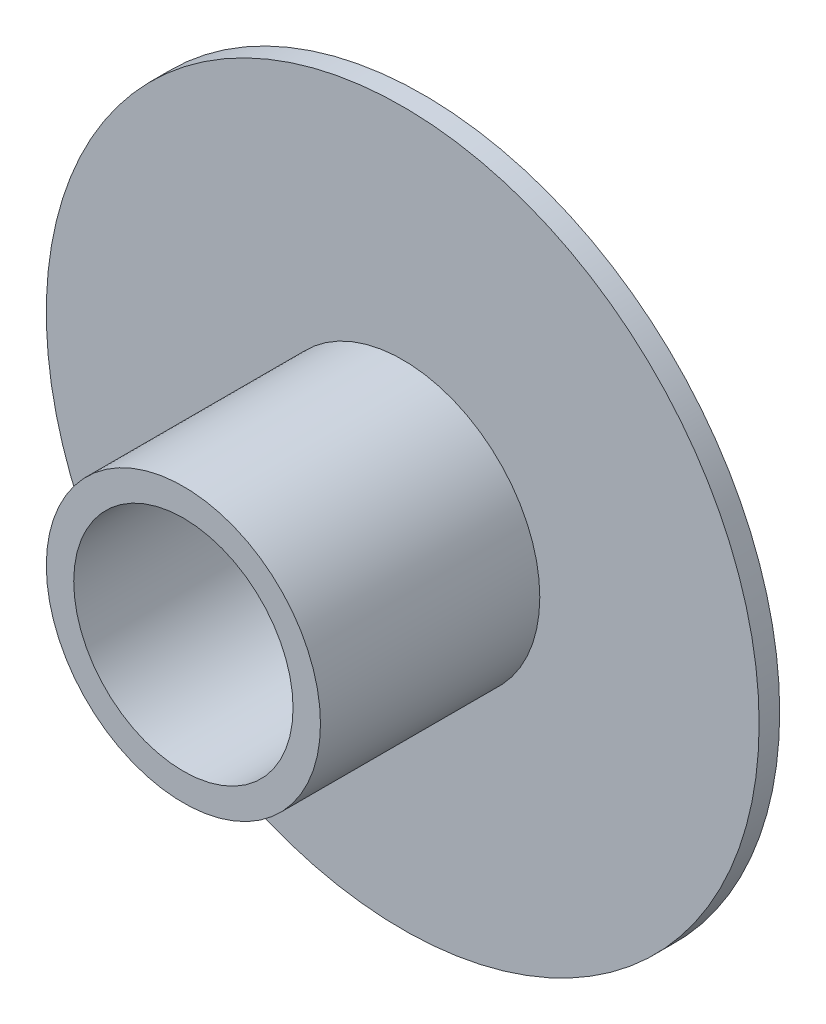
ISO-10303-21;
HEADER;
FILE_DESCRIPTION(('STEP AP214'),'2;1');
FILE_NAME('part.step','',(''),(''),'','','');
FILE_SCHEMA(('AUTOMOTIVE_DESIGN { 1 0 10303 214 1 1 1 1 }'));
ENDSEC;
DATA;
#1=APPLICATION_CONTEXT('core data for automotive mechanical design processes');
#2=APPLICATION_PROTOCOL_DEFINITION('international standard','automotive_design',2000,#1);
#3=PRODUCT_CONTEXT('',#1,'mechanical');
#4=PRODUCT('Part','Part','',(#3));
#5=PRODUCT_RELATED_PRODUCT_CATEGORY('part','',(#4));
#6=PRODUCT_DEFINITION_FORMATION('','',#4);
#7=PRODUCT_DEFINITION_CONTEXT('part definition',#1,'design');
#8=PRODUCT_DEFINITION('design','',#6,#7);
#9=PRODUCT_DEFINITION_SHAPE('','',#8);
#10=(LENGTH_UNIT() NAMED_UNIT(*) SI_UNIT(.MILLI.,.METRE.));
#11=(NAMED_UNIT(*) PLANE_ANGLE_UNIT() SI_UNIT($,.RADIAN.));
#12=(NAMED_UNIT(*) SI_UNIT($,.STERADIAN.) SOLID_ANGLE_UNIT());
#13=UNCERTAINTY_MEASURE_WITH_UNIT(LENGTH_MEASURE(1.E-05),#10,'distance_accuracy_value','');
#14=(GEOMETRIC_REPRESENTATION_CONTEXT(3) GLOBAL_UNCERTAINTY_ASSIGNED_CONTEXT((#13)) GLOBAL_UNIT_ASSIGNED_CONTEXT((#10,
#11,#12)) REPRESENTATION_CONTEXT('',''));
#15=CARTESIAN_POINT('',(0.,0.,0.));
#16=DIRECTION('',(0.,0.,1.));
#17=DIRECTION('',(1.,0.,0.));
#18=AXIS2_PLACEMENT_3D('',#15,#16,#17);
#19=CARTESIAN_POINT('',(0.,0.,0.75));
#20=DIRECTION('',(0.,0.,1.));
#21=DIRECTION('',(1.,0.,0.));
#22=AXIS2_PLACEMENT_3D('',#19,#20,#21);
#23=CYLINDRICAL_SURFACE('',#22,5.);
#24=CARTESIAN_POINT('',(0.,0.,0.75));
#25=DIRECTION('',(0.,0.,1.));
#26=DIRECTION('',(1.,0.,0.));
#27=AXIS2_PLACEMENT_3D('',#24,#25,#26);
#28=CIRCLE('',#27,5.);
#29=CARTESIAN_POINT('',(5.,0.,0.75));
#30=VERTEX_POINT('',#29);
#31=EDGE_CURVE('E16',#30,#30,#28,.T.);
#32=ORIENTED_EDGE('',*,*,#31,.T.);
#33=EDGE_LOOP('',(#32));
#34=FACE_BOUND('',#33,.T.);
#35=CARTESIAN_POINT('',(0.,0.,8.75));
#36=DIRECTION('',(0.,0.,1.));
#37=DIRECTION('',(1.,0.,0.));
#38=AXIS2_PLACEMENT_3D('',#35,#36,#37);
#39=CIRCLE('',#38,5.);
#40=CARTESIAN_POINT('',(5.,0.,8.75));
#41=VERTEX_POINT('',#40);
#42=EDGE_CURVE('E32',#41,#41,#39,.F.);
#43=ORIENTED_EDGE('',*,*,#42,.T.);
#44=EDGE_LOOP('',(#43));
#45=FACE_BOUND('',#44,.T.);
#46=ADVANCED_FACE('F13',(#34,#45),#23,.T.);
#47=CARTESIAN_POINT('',(0.,0.,0.75));
#48=DIRECTION('',(0.,0.,-1.));
#49=DIRECTION('',(-1.,0.,0.));
#50=AXIS2_PLACEMENT_3D('',#47,#48,#49);
#51=PLANE('',#50);
#52=ORIENTED_EDGE('',*,*,#31,.F.);
#53=EDGE_LOOP('',(#52));
#54=FACE_BOUND('',#53,.T.);
#55=CARTESIAN_POINT('',(0.,0.,0.75));
#56=DIRECTION('',(0.,0.,1.));
#57=DIRECTION('',(1.,0.,0.));
#58=AXIS2_PLACEMENT_3D('',#55,#56,#57);
#59=CIRCLE('',#58,13.);
#60=CARTESIAN_POINT('',(13.,0.,0.75));
#61=VERTEX_POINT('',#60);
#62=EDGE_CURVE('E30',#61,#61,#59,.F.);
#63=ORIENTED_EDGE('',*,*,#62,.F.);
#64=EDGE_LOOP('',(#63));
#65=FACE_BOUND('',#64,.T.);
#66=ADVANCED_FACE('F40',(#54,#65),#51,.F.);
#67=CARTESIAN_POINT('',(0.,0.,8.75));
#68=DIRECTION('',(0.,0.,-1.));
#69=DIRECTION('',(-1.,0.,0.));
#70=AXIS2_PLACEMENT_3D('',#67,#68,#69);
#71=PLANE('',#70);
#72=CARTESIAN_POINT('',(0.,0.,8.75));
#73=DIRECTION('',(0.,0.,1.));
#74=DIRECTION('',(1.,0.,0.));
#75=AXIS2_PLACEMENT_3D('',#72,#73,#74);
#76=CIRCLE('',#75,4.);
#77=CARTESIAN_POINT('',(4.,0.,8.75));
#78=VERTEX_POINT('',#77);
#79=EDGE_CURVE('E25',#78,#78,#76,.F.);
#80=ORIENTED_EDGE('',*,*,#79,.T.);
#81=EDGE_LOOP('',(#80));
#82=FACE_BOUND('',#81,.T.);
#83=ORIENTED_EDGE('',*,*,#42,.F.);
#84=EDGE_LOOP('',(#83));
#85=FACE_BOUND('',#84,.T.);
#86=ADVANCED_FACE('F43',(#82,#85),#71,.F.);
#87=CARTESIAN_POINT('',(0.,0.,0.));
#88=DIRECTION('',(0.,0.,1.));
#89=DIRECTION('',(1.,0.,0.));
#90=AXIS2_PLACEMENT_3D('',#87,#88,#89);
#91=CYLINDRICAL_SURFACE('',#90,13.);
#92=CARTESIAN_POINT('',(0.,0.,0.));
#93=DIRECTION('',(0.,0.,1.));
#94=DIRECTION('',(1.,0.,0.));
#95=AXIS2_PLACEMENT_3D('',#92,#93,#94);
#96=CIRCLE('',#95,13.);
#97=CARTESIAN_POINT('',(13.,0.,0.));
#98=VERTEX_POINT('',#97);
#99=EDGE_CURVE('E20',#98,#98,#96,.F.);
#100=ORIENTED_EDGE('',*,*,#99,.F.);
#101=EDGE_LOOP('',(#100));
#102=FACE_BOUND('',#101,.T.);
#103=ORIENTED_EDGE('',*,*,#62,.T.);
#104=EDGE_LOOP('',(#103));
#105=FACE_BOUND('',#104,.T.);
#106=ADVANCED_FACE('F46',(#102,#105),#91,.T.);
#107=CARTESIAN_POINT('',(0.,0.,0.));
#108=DIRECTION('',(0.,0.,1.));
#109=DIRECTION('',(1.,0.,0.));
#110=AXIS2_PLACEMENT_3D('',#107,#108,#109);
#111=CYLINDRICAL_SURFACE('',#110,4.);
#112=CARTESIAN_POINT('',(0.,0.,0.));
#113=DIRECTION('',(0.,0.,1.));
#114=DIRECTION('',(1.,0.,0.));
#115=AXIS2_PLACEMENT_3D('',#112,#113,#114);
#116=CIRCLE('',#115,4.);
#117=CARTESIAN_POINT('',(4.,0.,0.));
#118=VERTEX_POINT('',#117);
#119=EDGE_CURVE('E9',#118,#118,#116,.T.);
#120=ORIENTED_EDGE('',*,*,#119,.F.);
#121=EDGE_LOOP('',(#120));
#122=FACE_BOUND('',#121,.T.);
#123=ORIENTED_EDGE('',*,*,#79,.F.);
#124=EDGE_LOOP('',(#123));
#125=FACE_BOUND('',#124,.T.);
#126=ADVANCED_FACE('F48',(#122,#125),#111,.F.);
#127=CARTESIAN_POINT('',(0.,0.,0.));
#128=DIRECTION('',(0.,0.,-1.));
#129=DIRECTION('',(-1.,0.,0.));
#130=AXIS2_PLACEMENT_3D('',#127,#128,#129);
#131=PLANE('',#130);
#132=ORIENTED_EDGE('',*,*,#119,.T.);
#133=EDGE_LOOP('',(#132));
#134=FACE_BOUND('',#133,.T.);
#135=ORIENTED_EDGE('',*,*,#99,.T.);
#136=EDGE_LOOP('',(#135));
#137=FACE_BOUND('',#136,.T.);
#138=ADVANCED_FACE('F56',(#134,#137),#131,.T.);
#139=CLOSED_SHELL('',(#46,#66,#86,#106,#126,#138));
#140=MANIFOLD_SOLID_BREP('B1',#139);
#141=ADVANCED_BREP_SHAPE_REPRESENTATION('',(#18,#140),#14);
#142=SHAPE_DEFINITION_REPRESENTATION(#9,#141);
ENDSEC;
END-ISO-10303-21;
